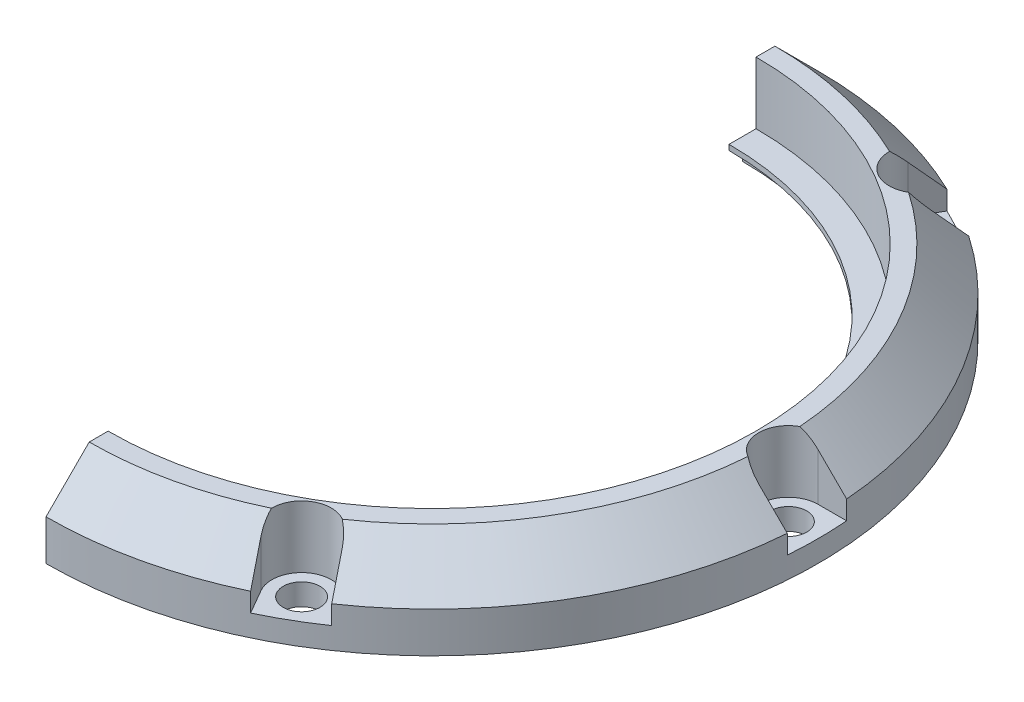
ISO-10303-21;
HEADER;
FILE_DESCRIPTION(('STEP AP214'),'2;1');
FILE_NAME('part.step','',(''),(''),'','','');
FILE_SCHEMA(('AUTOMOTIVE_DESIGN { 1 0 10303 214 1 1 1 1 }'));
ENDSEC;
DATA;
#1=APPLICATION_CONTEXT('core data for automotive mechanical design processes');
#2=APPLICATION_PROTOCOL_DEFINITION('international standard','automotive_design',2000,#1);
#3=PRODUCT_CONTEXT('',#1,'mechanical');
#4=PRODUCT('Part','Part','',(#3));
#5=PRODUCT_RELATED_PRODUCT_CATEGORY('part','',(#4));
#6=PRODUCT_DEFINITION_FORMATION('','',#4);
#7=PRODUCT_DEFINITION_CONTEXT('part definition',#1,'design');
#8=PRODUCT_DEFINITION('design','',#6,#7);
#9=PRODUCT_DEFINITION_SHAPE('','',#8);
#10=(LENGTH_UNIT() NAMED_UNIT(*) SI_UNIT(.MILLI.,.METRE.));
#11=(NAMED_UNIT(*) PLANE_ANGLE_UNIT() SI_UNIT($,.RADIAN.));
#12=(NAMED_UNIT(*) SI_UNIT($,.STERADIAN.) SOLID_ANGLE_UNIT());
#13=UNCERTAINTY_MEASURE_WITH_UNIT(LENGTH_MEASURE(1.E-05),#10,'distance_accuracy_value','');
#14=(GEOMETRIC_REPRESENTATION_CONTEXT(3) GLOBAL_UNCERTAINTY_ASSIGNED_CONTEXT((#13)) GLOBAL_UNIT_ASSIGNED_CONTEXT((#10,
#11,#12)) REPRESENTATION_CONTEXT('',''));
#15=CARTESIAN_POINT('',(0.,0.,0.));
#16=DIRECTION('',(0.,0.,1.));
#17=DIRECTION('',(1.,0.,0.));
#18=AXIS2_PLACEMENT_3D('',#15,#16,#17);
#19=CARTESIAN_POINT('',(0.,-6.5,-12.5));
#20=DIRECTION('',(0.,1.,0.));
#21=DIRECTION('',(0.,0.,1.));
#22=AXIS2_PLACEMENT_3D('',#19,#20,#21);
#23=PLANE('',#22);
#24=CARTESIAN_POINT('',(0.,-6.5,-72.5));
#25=DIRECTION('',(0.,-1.,0.));
#26=DIRECTION('',(0.,0.,-1.));
#27=AXIS2_PLACEMENT_3D('',#24,#25,#26);
#28=CIRCLE('',#27,60.);
#29=CARTESIAN_POINT('',(48.2505378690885,-6.5,-36.8364949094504));
#30=VERTEX_POINT('',#29);
#31=CARTESIAN_POINT('',(0.,-6.5,-12.5));
#32=VERTEX_POINT('',#31);
#33=EDGE_CURVE('E458',#30,#32,#28,.T.);
#34=ORIENTED_EDGE('',*,*,#33,.F.);
#35=CARTESIAN_POINT('',(47.0442744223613,-6.5,-37.7280825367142));
#36=DIRECTION('',(0.,1.,0.));
#37=DIRECTION('',(0.,0.,1.));
#38=AXIS2_PLACEMENT_3D('',#35,#36,#37);
#39=CIRCLE('',#38,1.5);
#40=CARTESIAN_POINT('',(47.9046390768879,-6.5,-38.9568106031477));
#41=VERTEX_POINT('',#40);
#42=EDGE_CURVE('E39',#30,#41,#39,.T.);
#43=ORIENTED_EDGE('',*,*,#42,.T.);
#44=DIRECTION('',(0.819152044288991,0.,0.573576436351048));
#45=VECTOR('',#44,1.);
#46=CARTESIAN_POINT('',(45.0533624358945,-6.5,-40.9532960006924));
#47=LINE('',#46,#45);
#48=CARTESIAN_POINT('',(45.0533624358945,-6.5,-40.9532960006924));
#49=VERTEX_POINT('',#48);
#50=EDGE_CURVE('E901',#49,#41,#47,.T.);
#51=ORIENTED_EDGE('',*,*,#50,.F.);
#52=CARTESIAN_POINT('',(0.,-6.5,-72.5));
#53=DIRECTION('',(0.,-1.,0.));
#54=DIRECTION('',(0.,0.,-1.));
#55=AXIS2_PLACEMENT_3D('',#52,#53,#54);
#56=CIRCLE('',#55,55.);
#57=CARTESIAN_POINT('',(0.,-6.5,-17.5));
#58=VERTEX_POINT('',#57);
#59=EDGE_CURVE('E234',#49,#58,#56,.T.);
#60=ORIENTED_EDGE('',*,*,#59,.T.);
#61=DIRECTION('',(0.,0.,1.));
#62=VECTOR('',#61,1.);
#63=CARTESIAN_POINT('',(0.,-6.5,-12.5));
#64=LINE('',#63,#62);
#65=EDGE_CURVE('E497',#58,#32,#64,.T.);
#66=ORIENTED_EDGE('',*,*,#65,.T.);
#67=EDGE_LOOP('',(#34,#43,#51,#60,#66));
#68=FACE_BOUND('',#67,.T.);
#69=ADVANCED_FACE('F16',(#68),#23,.T.);
#70=DIRECTION('',(-1.,0.,0.));
#71=VECTOR('',#70,1.);
#72=CARTESIAN_POINT('',(55.,-6.5,-72.5));
#73=LINE('',#72,#71);
#74=CARTESIAN_POINT('',(58.4807660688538,-6.5,-72.5));
#75=VERTEX_POINT('',#74);
#76=CARTESIAN_POINT('',(55.,-6.5,-72.5));
#77=VERTEX_POINT('',#76);
#78=EDGE_CURVE('E228',#75,#77,#73,.T.);
#79=ORIENTED_EDGE('',*,*,#78,.F.);
#80=CARTESIAN_POINT('',(58.4807660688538,-6.5,-74.));
#81=DIRECTION('',(0.,1.,0.));
#82=DIRECTION('',(0.,0.,1.));
#83=AXIS2_PLACEMENT_3D('',#80,#81,#82);
#84=CIRCLE('',#83,1.5);
#85=CARTESIAN_POINT('',(59.9802728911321,-6.5,-74.0384615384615));
#86=VERTEX_POINT('',#85);
#87=EDGE_CURVE('E441',#75,#86,#84,.T.);
#88=ORIENTED_EDGE('',*,*,#87,.T.);
#89=CARTESIAN_POINT('',(0.,-6.5,-132.5));
#90=VERTEX_POINT('',#89);
#91=EDGE_CURVE('E455',#90,#86,#28,.T.);
#92=ORIENTED_EDGE('',*,*,#91,.F.);
#93=CARTESIAN_POINT('',(0.,-6.5,-127.5));
#94=VERTEX_POINT('',#93);
#95=EDGE_CURVE('E495',#90,#94,#64,.T.);
#96=ORIENTED_EDGE('',*,*,#95,.T.);
#97=EDGE_CURVE('E309',#94,#77,#56,.T.);
#98=ORIENTED_EDGE('',*,*,#97,.T.);
#99=EDGE_LOOP('',(#79,#88,#92,#96,#98));
#100=FACE_BOUND('',#99,.T.);
#101=ADVANCED_FACE('F397',(#100),#23,.T.);
#102=CARTESIAN_POINT('',(0.,-10.5,-72.5));
#103=DIRECTION('',(0.,-1.,0.));
#104=DIRECTION('',(0.,0.,-1.));
#105=AXIS2_PLACEMENT_3D('',#102,#103,#104);
#106=CYLINDRICAL_SURFACE('',#105,60.);
#107=ORIENTED_EDGE('',*,*,#91,.T.);
#108=DIRECTION('',(0.,-1.,0.));
#109=VECTOR('',#108,1.);
#110=CARTESIAN_POINT('',(59.9802728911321,-10.5,-74.0384615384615));
#111=LINE('',#110,#109);
#112=CARTESIAN_POINT('',(59.9802728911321,-1.49999999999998,-74.0384615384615));
#113=VERTEX_POINT('',#112);
#114=EDGE_CURVE('E431',#86,#113,#111,.F.);
#115=ORIENTED_EDGE('',*,*,#114,.T.);
#116=CARTESIAN_POINT('',(0.,-1.49999999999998,-72.5));
#117=DIRECTION('',(0.,1.,0.));
#118=DIRECTION('',(0.,0.,1.));
#119=AXIS2_PLACEMENT_3D('',#116,#117,#118);
#120=CIRCLE('',#119,60.);
#121=CARTESIAN_POINT('',(48.2505378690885,-1.49999999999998,-36.8364949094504));
#122=VERTEX_POINT('',#121);
#123=EDGE_CURVE('E218',#122,#113,#120,.T.);
#124=ORIENTED_EDGE('',*,*,#123,.F.);
#125=DIRECTION('',(0.,-1.,0.));
#126=VECTOR('',#125,1.);
#127=CARTESIAN_POINT('',(48.2505378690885,-10.5,-36.8364949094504));
#128=LINE('',#127,#126);
#129=EDGE_CURVE('E438',#122,#30,#128,.T.);
#130=ORIENTED_EDGE('',*,*,#129,.T.);
#131=ORIENTED_EDGE('',*,*,#33,.T.);
#132=DIRECTION('',(0.,-1.,0.));
#133=VECTOR('',#132,1.);
#134=CARTESIAN_POINT('',(0.,-10.5,-12.5));
#135=LINE('',#134,#133);
#136=CARTESIAN_POINT('',(0.,5.,-12.5));
#137=VERTEX_POINT('',#136);
#138=EDGE_CURVE('E500',#32,#137,#135,.F.);
#139=ORIENTED_EDGE('',*,*,#138,.T.);
#140=CARTESIAN_POINT('',(0.,5.,-72.5));
#141=DIRECTION('',(0.,-1.,0.));
#142=DIRECTION('',(0.,0.,-1.));
#143=AXIS2_PLACEMENT_3D('',#140,#141,#142);
#144=CIRCLE('',#143,60.);
#145=CARTESIAN_POINT('',(0.,5.,-132.5));
#146=VERTEX_POINT('',#145);
#147=EDGE_CURVE('E459',#146,#137,#144,.T.);
#148=ORIENTED_EDGE('',*,*,#147,.F.);
#149=DIRECTION('',(0.,-1.,0.));
#150=VECTOR('',#149,1.);
#151=CARTESIAN_POINT('',(0.,-10.5,-132.5));
#152=LINE('',#151,#150);
#153=EDGE_CURVE('E498',#146,#90,#152,.T.);
#154=ORIENTED_EDGE('',*,*,#153,.T.);
#155=EDGE_LOOP('',(#107,#115,#124,#130,#131,#139,#148,#154));
#156=FACE_BOUND('',#155,.T.);
#157=ADVANCED_FACE('F296',(#156),#106,.F.);
#158=CARTESIAN_POINT('',(0.,-10.51,-144.));
#159=DIRECTION('',(-1.,0.,0.));
#160=DIRECTION('',(0.,0.,1.));
#161=AXIS2_PLACEMENT_3D('',#158,#159,#160);
#162=PLANE('',#161);
#163=DIRECTION('',(0.,0.707106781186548,-0.707106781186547));
#164=VECTOR('',#163,1.);
#165=CARTESIAN_POINT('',(0.,68.5,-72.5));
#166=LINE('',#165,#164);
#167=CARTESIAN_POINT('',(0.,5.,-9.));
#168=VERTEX_POINT('',#167);
#169=CARTESIAN_POINT('',(0.,-3.,-1.));
#170=VERTEX_POINT('',#169);
#171=EDGE_CURVE('E487',#168,#170,#166,.F.);
#172=ORIENTED_EDGE('',*,*,#171,.F.);
#173=DIRECTION('',(0.,0.,1.));
#174=VECTOR('',#173,1.);
#175=CARTESIAN_POINT('',(0.,5.,-9.));
#176=LINE('',#175,#174);
#177=EDGE_CURVE('E504',#137,#168,#176,.T.);
#178=ORIENTED_EDGE('',*,*,#177,.F.);
#179=ORIENTED_EDGE('',*,*,#138,.F.);
#180=ORIENTED_EDGE('',*,*,#65,.F.);
#181=DIRECTION('',(0.,-1.,0.));
#182=VECTOR('',#181,1.);
#183=CARTESIAN_POINT('',(0.,-10.5,-17.5));
#184=LINE('',#183,#182);
#185=CARTESIAN_POINT('',(0.,-7.5,-17.5));
#186=VERTEX_POINT('',#185);
#187=EDGE_CURVE('E482',#186,#58,#184,.F.);
#188=ORIENTED_EDGE('',*,*,#187,.F.);
#189=DIRECTION('',(0.,0.,-1.));
#190=VECTOR('',#189,1.);
#191=CARTESIAN_POINT('',(0.,-7.5,-72.5));
#192=LINE('',#191,#190);
#193=CARTESIAN_POINT('',(0.,-7.5,-15.));
#194=VERTEX_POINT('',#193);
#195=EDGE_CURVE('E511',#194,#186,#192,.T.);
#196=ORIENTED_EDGE('',*,*,#195,.F.);
#197=DIRECTION('',(0.,-1.,0.));
#198=VECTOR('',#197,1.);
#199=CARTESIAN_POINT('',(0.,-7.5,-15.));
#200=LINE('',#199,#198);
#201=CARTESIAN_POINT('',(0.,-10.5,-15.));
#202=VERTEX_POINT('',#201);
#203=EDGE_CURVE('E235',#194,#202,#200,.T.);
#204=ORIENTED_EDGE('',*,*,#203,.T.);
#205=DIRECTION('',(0.,0.,-1.));
#206=VECTOR('',#205,1.);
#207=CARTESIAN_POINT('',(0.,-10.5,-1000.));
#208=LINE('',#207,#206);
#209=CARTESIAN_POINT('',(0.,-10.5,-1.));
#210=VERTEX_POINT('',#209);
#211=EDGE_CURVE('E506',#210,#202,#208,.T.);
#212=ORIENTED_EDGE('',*,*,#211,.F.);
#213=DIRECTION('',(0.,-1.,0.));
#214=VECTOR('',#213,1.);
#215=CARTESIAN_POINT('',(0.,-10.5,-1.00000000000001));
#216=LINE('',#215,#214);
#217=EDGE_CURVE('E492',#170,#210,#216,.T.);
#218=ORIENTED_EDGE('',*,*,#217,.F.);
#219=EDGE_LOOP('',(#172,#178,#179,#180,#188,#196,#204,#212,#218));
#220=FACE_BOUND('',#219,.T.);
#221=ADVANCED_FACE('F379',(#220),#162,.T.);
#222=DIRECTION('',(0.,-0.707106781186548,-0.707106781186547));
#223=VECTOR('',#222,1.);
#224=CARTESIAN_POINT('',(0.,68.5,-72.5));
#225=LINE('',#224,#223);
#226=CARTESIAN_POINT('',(0.,-3.,-144.));
#227=VERTEX_POINT('',#226);
#228=CARTESIAN_POINT('',(0.,5.,-136.));
#229=VERTEX_POINT('',#228);
#230=EDGE_CURVE('E484',#227,#229,#225,.F.);
#231=ORIENTED_EDGE('',*,*,#230,.F.);
#232=DIRECTION('',(0.,-1.,0.));
#233=VECTOR('',#232,1.);
#234=CARTESIAN_POINT('',(0.,-10.5,-144.));
#235=LINE('',#234,#233);
#236=CARTESIAN_POINT('',(0.,-10.5,-144.));
#237=VERTEX_POINT('',#236);
#238=EDGE_CURVE('E490',#237,#227,#235,.F.);
#239=ORIENTED_EDGE('',*,*,#238,.F.);
#240=CARTESIAN_POINT('',(0.,-10.5,-130.));
#241=VERTEX_POINT('',#240);
#242=EDGE_CURVE('E509',#241,#237,#208,.T.);
#243=ORIENTED_EDGE('',*,*,#242,.F.);
#244=DIRECTION('',(0.,-1.,0.));
#245=VECTOR('',#244,1.);
#246=CARTESIAN_POINT('',(0.,-7.5,-130.));
#247=LINE('',#246,#245);
#248=CARTESIAN_POINT('',(0.,-7.5,-130.));
#249=VERTEX_POINT('',#248);
#250=EDGE_CURVE('E239',#241,#249,#247,.F.);
#251=ORIENTED_EDGE('',*,*,#250,.T.);
#252=CARTESIAN_POINT('',(0.,-7.5,-127.5));
#253=VERTEX_POINT('',#252);
#254=EDGE_CURVE('E248',#253,#249,#192,.T.);
#255=ORIENTED_EDGE('',*,*,#254,.F.);
#256=DIRECTION('',(0.,-1.,0.));
#257=VECTOR('',#256,1.);
#258=CARTESIAN_POINT('',(0.,-10.5,-127.5));
#259=LINE('',#258,#257);
#260=EDGE_CURVE('E479',#94,#253,#259,.T.);
#261=ORIENTED_EDGE('',*,*,#260,.F.);
#262=ORIENTED_EDGE('',*,*,#95,.F.);
#263=ORIENTED_EDGE('',*,*,#153,.F.);
#264=EDGE_CURVE('E503',#229,#146,#176,.T.);
#265=ORIENTED_EDGE('',*,*,#264,.F.);
#266=EDGE_LOOP('',(#231,#239,#243,#251,#255,#261,#262,#263,#265));
#267=FACE_BOUND('',#266,.T.);
#268=ADVANCED_FACE('F294',(#267),#162,.T.);
#269=CARTESIAN_POINT('',(28.2368602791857,5.,-12.5923233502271));
#270=DIRECTION('',(0.866025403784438,0.,-0.5));
#271=DIRECTION('',(-0.5,0.,-0.866025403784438));
#272=AXIS2_PLACEMENT_3D('',#269,#270,#271);
#273=PLANE('',#272);
#274=DIRECTION('',(0.,-1.,0.));
#275=VECTOR('',#274,1.);
#276=CARTESIAN_POINT('',(30.8809341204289,-10.5,-8.01265311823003));
#277=LINE('',#276,#275);
#278=CARTESIAN_POINT('',(30.8809341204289,-6.5,-8.01265311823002));
#279=VERTEX_POINT('',#278);
#280=CARTESIAN_POINT('',(30.8809341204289,-3.,-8.01265311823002));
#281=VERTEX_POINT('',#280);
#282=EDGE_CURVE('E618',#279,#281,#277,.F.);
#283=ORIENTED_EDGE('',*,*,#282,.F.);
#284=DIRECTION('',(0.5,0.,0.866025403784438));
#285=VECTOR('',#284,1.);
#286=CARTESIAN_POINT('',(28.2368602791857,-6.5,-12.5923233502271));
#287=LINE('',#286,#285);
#288=CARTESIAN_POINT('',(28.2368602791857,-6.5,-12.5923233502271));
#289=VERTEX_POINT('',#288);
#290=EDGE_CURVE('E326',#289,#279,#287,.T.);
#291=ORIENTED_EDGE('',*,*,#290,.F.);
#292=DIRECTION('',(0.,-1.,0.));
#293=VECTOR('',#292,1.);
#294=CARTESIAN_POINT('',(28.2368602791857,5.,-12.5923233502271));
#295=LINE('',#294,#293);
#296=CARTESIAN_POINT('',(28.2368602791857,2.27122981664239,-12.5923233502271));
#297=VERTEX_POINT('',#296);
#298=EDGE_CURVE('E316',#297,#289,#295,.T.);
#299=ORIENTED_EDGE('',*,*,#298,.F.);
#300=CARTESIAN_POINT('',(30.8810344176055,-3.0002,-8.01247939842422));
#301=CARTESIAN_POINT('',(30.4403735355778,-2.12148155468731,-8.77572643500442));
#302=CARTESIAN_POINT('',(29.999685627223,-1.24281733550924,-9.53902028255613));
#303=CARTESIAN_POINT('',(29.1182557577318,0.514402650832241,-11.0657015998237));
#304=CARTESIAN_POINT('',(28.6775137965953,1.39295841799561,-11.8290890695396));
#305=CARTESIAN_POINT('',(28.2367448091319,2.27145995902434,-12.5925233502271));
#306=B_SPLINE_CURVE_WITH_KNOTS('',3,(#300,#301,#302,#303,#304,#305),.UNSPECIFIED.,.F.,.F.,(4,2,
4),(0.,3.73361316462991,7.46722633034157),.UNSPECIFIED.);
#307=EDGE_CURVE('E301',#281,#297,#306,.T.);
#308=ORIENTED_EDGE('',*,*,#307,.F.);
#309=EDGE_LOOP('',(#283,#291,#299,#308));
#310=FACE_BOUND('',#309,.T.);
#311=ADVANCED_FACE('F288',(#310),#273,.T.);
#312=CARTESIAN_POINT('',(33.,-6.5,-15.3423233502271));
#313=DIRECTION('',(0.,1.,0.));
#314=DIRECTION('',(0.,0.,1.));
#315=AXIS2_PLACEMENT_3D('',#312,#313,#314);
#316=PLANE('',#315);
#317=CARTESIAN_POINT('',(33.,-6.5,-15.3423233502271));
#318=DIRECTION('',(0.,1.,0.));
#319=DIRECTION('',(0.,0.,1.));
#320=AXIS2_PLACEMENT_3D('',#317,#318,#319);
#321=CIRCLE('',#320,3.4);
#322=CARTESIAN_POINT('',(33.,-6.5,-11.9423233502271));
#323=VERTEX_POINT('',#322);
#324=EDGE_CURVE('E333',#323,#323,#321,.T.);
#325=ORIENTED_EDGE('',*,*,#324,.F.);
#326=EDGE_LOOP('',(#325));
#327=FACE_BOUND('',#326,.T.);
#328=CARTESIAN_POINT('',(33.,-6.5,-15.3423233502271));
#329=DIRECTION('',(0.,1.,0.));
#330=DIRECTION('',(0.,0.,1.));
#331=AXIS2_PLACEMENT_3D('',#328,#329,#330);
#332=CIRCLE('',#331,5.5);
#333=CARTESIAN_POINT('',(37.7631397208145,-6.5,-18.0923233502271));
#334=VERTEX_POINT('',#333);
#335=EDGE_CURVE('E328',#334,#289,#332,.T.);
#336=ORIENTED_EDGE('',*,*,#335,.T.);
#337=ORIENTED_EDGE('',*,*,#290,.T.);
#338=CARTESIAN_POINT('',(0.,-6.5,-72.5));
#339=DIRECTION('',(0.,1.,0.));
#340=DIRECTION('',(0.,0.,1.));
#341=AXIS2_PLACEMENT_3D('',#338,#339,#340);
#342=CIRCLE('',#341,71.5);
#343=CARTESIAN_POINT('',(40.4072135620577,-6.5,-13.51265311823));
#344=VERTEX_POINT('',#343);
#345=EDGE_CURVE('E324',#279,#344,#342,.T.);
#346=ORIENTED_EDGE('',*,*,#345,.T.);
#347=DIRECTION('',(-0.5,0.,-0.866025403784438));
#348=VECTOR('',#347,1.);
#349=CARTESIAN_POINT('',(37.7631397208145,-6.5,-18.0923233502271));
#350=LINE('',#349,#348);
#351=EDGE_CURVE('E321',#344,#334,#350,.T.);
#352=ORIENTED_EDGE('',*,*,#351,.T.);
#353=EDGE_LOOP('',(#336,#337,#346,#352));
#354=FACE_BOUND('',#353,.T.);
#355=ADVANCED_FACE('F293',(#327,#354),#316,.T.);
#356=CARTESIAN_POINT('',(37.7631397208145,5.,-18.0923233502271));
#357=DIRECTION('',(-0.866025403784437,0.,0.5));
#358=DIRECTION('',(0.5,0.,0.866025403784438));
#359=AXIS2_PLACEMENT_3D('',#356,#357,#358);
#360=PLANE('',#359);
#361=DIRECTION('',(0.,-1.,0.));
#362=VECTOR('',#361,1.);
#363=CARTESIAN_POINT('',(37.7631397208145,5.,-18.0923233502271));
#364=LINE('',#363,#362);
#365=CARTESIAN_POINT('',(37.7631397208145,2.27122981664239,-18.0923233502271));
#366=VERTEX_POINT('',#365);
#367=EDGE_CURVE('E318',#366,#334,#364,.T.);
#368=ORIENTED_EDGE('',*,*,#367,.T.);
#369=ORIENTED_EDGE('',*,*,#351,.F.);
#370=DIRECTION('',(0.,-1.,0.));
#371=VECTOR('',#370,1.);
#372=CARTESIAN_POINT('',(40.4072135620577,-10.5,-13.51265311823));
#373=LINE('',#372,#371);
#374=CARTESIAN_POINT('',(40.4072135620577,-3.,-13.51265311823));
#375=VERTEX_POINT('',#374);
#376=EDGE_CURVE('E310',#375,#344,#373,.T.);
#377=ORIENTED_EDGE('',*,*,#376,.F.);
#378=CARTESIAN_POINT('',(37.7630242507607,2.27145995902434,-18.0925233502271));
#379=CARTESIAN_POINT('',(38.2037932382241,1.39295841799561,-17.3290890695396));
#380=CARTESIAN_POINT('',(38.6445351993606,0.514402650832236,-16.5657015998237));
#381=CARTESIAN_POINT('',(39.5259650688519,-1.24281733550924,-15.0390202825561));
#382=CARTESIAN_POINT('',(39.9666529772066,-2.12148155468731,-14.2757264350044));
#383=CARTESIAN_POINT('',(40.4073138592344,-3.0002,-13.5124793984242));
#384=B_SPLINE_CURVE_WITH_KNOTS('',3,(#378,#379,#380,#381,#382,#383),.UNSPECIFIED.,.F.,.F.,(4,2,
4),(0.,3.73361316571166,7.46722633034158),.UNSPECIFIED.);
#385=EDGE_CURVE('E308',#366,#375,#384,.T.);
#386=ORIENTED_EDGE('',*,*,#385,.F.);
#387=EDGE_LOOP('',(#368,#369,#377,#386));
#388=FACE_BOUND('',#387,.T.);
#389=ADVANCED_FACE('F297',(#388),#360,.T.);
#390=CARTESIAN_POINT('',(66.,5.,-67.));
#391=DIRECTION('',(0.,0.,-1.));
#392=DIRECTION('',(-1.,0.,0.));
#393=AXIS2_PLACEMENT_3D('',#390,#391,#392);
#394=PLANE('',#393);
#395=DIRECTION('',(0.,-1.,0.));
#396=VECTOR('',#395,1.);
#397=CARTESIAN_POINT('',(71.2881476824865,-10.5,-67.));
#398=LINE('',#397,#396);
#399=CARTESIAN_POINT('',(71.2881476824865,-6.5,-67.));
#400=VERTEX_POINT('',#399);
#401=CARTESIAN_POINT('',(71.2881476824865,-3.,-67.));
#402=VERTEX_POINT('',#401);
#403=EDGE_CURVE('E244',#400,#402,#398,.F.);
#404=ORIENTED_EDGE('',*,*,#403,.F.);
#405=DIRECTION('',(1.,0.,0.));
#406=VECTOR('',#405,1.);
#407=CARTESIAN_POINT('',(66.,-6.5,-67.));
#408=LINE('',#407,#406);
#409=CARTESIAN_POINT('',(66.,-6.5,-67.));
#410=VERTEX_POINT('',#409);
#411=EDGE_CURVE('E528',#410,#400,#408,.T.);
#412=ORIENTED_EDGE('',*,*,#411,.F.);
#413=DIRECTION('',(0.,-1.,0.));
#414=VECTOR('',#413,1.);
#415=CARTESIAN_POINT('',(66.,5.,-67.));
#416=LINE('',#415,#414);
#417=CARTESIAN_POINT('',(66.,2.27122981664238,-67.));
#418=VERTEX_POINT('',#417);
#419=EDGE_CURVE('E538',#418,#410,#416,.T.);
#420=ORIENTED_EDGE('',*,*,#419,.F.);
#421=CARTESIAN_POINT('',(80.8781602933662,-12.5649542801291,-67.));
#422=CARTESIAN_POINT('',(78.8401535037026,-10.5316539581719,-67.));
#423=CARTESIAN_POINT('',(76.8019801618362,-8.4985205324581,-67.));
#424=CARTESIAN_POINT('',(72.7251831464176,-4.43270559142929,-67.));
#425=CARTESIAN_POINT('',(70.6865594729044,-2.40002407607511,-67.));
#426=CARTESIAN_POINT('',(66.6087441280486,1.66476936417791,-67.));
#427=CARTESIAN_POINT('',(64.5695524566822,3.69688128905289,-67.));
#428=CARTESIAN_POINT('',(60.4903984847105,7.76033186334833,-67.));
#429=CARTESIAN_POINT('',(58.4504361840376,9.79167051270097,-67.));
#430=CARTESIAN_POINT('',(56.4099873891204,11.8225205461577,-67.));
#431=B_SPLINE_CURVE_WITH_KNOTS('',3,(#421,#422,#423,#424,#425,#426,#427,#428,#429,#430),
.UNSPECIFIED.,.F.,.F.,(4,2,2,2,4),(0.,8.63655240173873,17.2731040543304,25.9096560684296,
34.5462088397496),.UNSPECIFIED.);
#432=EDGE_CURVE('E336',#402,#418,#431,.T.);
#433=ORIENTED_EDGE('',*,*,#432,.F.);
#434=EDGE_LOOP('',(#404,#412,#420,#433));
#435=FACE_BOUND('',#434,.T.);
#436=ADVANCED_FACE('F351',(#435),#394,.T.);
#437=CARTESIAN_POINT('',(66.,-6.5,-72.5));
#438=DIRECTION('',(0.,1.,0.));
#439=DIRECTION('',(0.86602540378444,0.,0.5));
#440=AXIS2_PLACEMENT_3D('',#437,#438,#439);
#441=PLANE('',#440);
#442=CARTESIAN_POINT('',(66.,-6.5,-72.5));
#443=DIRECTION('',(0.,1.,0.));
#444=DIRECTION('',(0.86602540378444,0.,0.5));
#445=AXIS2_PLACEMENT_3D('',#442,#443,#444);
#446=CIRCLE('',#445,3.4);
#447=CARTESIAN_POINT('',(68.9444863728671,-6.5,-70.8));
#448=VERTEX_POINT('',#447);
#449=EDGE_CURVE('E515',#448,#448,#446,.T.);
#450=ORIENTED_EDGE('',*,*,#449,.F.);
#451=EDGE_LOOP('',(#450));
#452=FACE_BOUND('',#451,.T.);
#453=CARTESIAN_POINT('',(66.,-6.5,-72.5));
#454=DIRECTION('',(0.,1.,0.));
#455=DIRECTION('',(0.86602540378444,0.,0.5));
#456=AXIS2_PLACEMENT_3D('',#453,#454,#455);
#457=CIRCLE('',#456,5.5);
#458=CARTESIAN_POINT('',(66.,-6.5,-78.));
#459=VERTEX_POINT('',#458);
#460=EDGE_CURVE('E524',#459,#410,#457,.T.);
#461=ORIENTED_EDGE('',*,*,#460,.T.);
#462=ORIENTED_EDGE('',*,*,#411,.T.);
#463=CARTESIAN_POINT('',(0.,-6.5,-72.5));
#464=DIRECTION('',(0.,1.,0.));
#465=DIRECTION('',(0.86602540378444,0.,0.5));
#466=AXIS2_PLACEMENT_3D('',#463,#464,#465);
#467=CIRCLE('',#466,71.5);
#468=CARTESIAN_POINT('',(71.2881476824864,-6.5,-78.));
#469=VERTEX_POINT('',#468);
#470=EDGE_CURVE('E531',#400,#469,#467,.T.);
#471=ORIENTED_EDGE('',*,*,#470,.T.);
#472=DIRECTION('',(-1.,0.,0.));
#473=VECTOR('',#472,1.);
#474=CARTESIAN_POINT('',(66.,-6.5,-78.));
#475=LINE('',#474,#473);
#476=EDGE_CURVE('E533',#469,#459,#475,.T.);
#477=ORIENTED_EDGE('',*,*,#476,.T.);
#478=EDGE_LOOP('',(#461,#462,#471,#477));
#479=FACE_BOUND('',#478,.T.);
#480=ADVANCED_FACE('F355',(#452,#479),#441,.T.);
#481=CARTESIAN_POINT('',(66.,5.,-78.));
#482=DIRECTION('',(0.,0.,1.));
#483=DIRECTION('',(1.,0.,0.));
#484=AXIS2_PLACEMENT_3D('',#481,#482,#483);
#485=PLANE('',#484);
#486=DIRECTION('',(0.,-1.,0.));
#487=VECTOR('',#486,1.);
#488=CARTESIAN_POINT('',(66.,5.,-78.));
#489=LINE('',#488,#487);
#490=CARTESIAN_POINT('',(66.,2.27122981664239,-78.));
#491=VERTEX_POINT('',#490);
#492=EDGE_CURVE('E536',#491,#459,#489,.T.);
#493=ORIENTED_EDGE('',*,*,#492,.T.);
#494=ORIENTED_EDGE('',*,*,#476,.F.);
#495=DIRECTION('',(0.,-1.,0.));
#496=VECTOR('',#495,1.);
#497=CARTESIAN_POINT('',(71.2881476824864,-10.5,-78.));
#498=LINE('',#497,#496);
#499=CARTESIAN_POINT('',(71.2881476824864,-3.,-78.));
#500=VERTEX_POINT('',#499);
#501=EDGE_CURVE('E247',#500,#469,#498,.T.);
#502=ORIENTED_EDGE('',*,*,#501,.F.);
#503=CARTESIAN_POINT('',(56.4099873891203,11.8225205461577,-78.));
#504=CARTESIAN_POINT('',(58.4504361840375,9.79167051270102,-78.));
#505=CARTESIAN_POINT('',(60.4903984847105,7.76033186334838,-78.));
#506=CARTESIAN_POINT('',(64.5695524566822,3.69688128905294,-78.));
#507=CARTESIAN_POINT('',(66.6087441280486,1.66476936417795,-78.));
#508=CARTESIAN_POINT('',(70.6865594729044,-2.40002407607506,-78.));
#509=CARTESIAN_POINT('',(72.7251831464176,-4.43270559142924,-78.));
#510=CARTESIAN_POINT('',(76.8019801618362,-8.49852053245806,-78.));
#511=CARTESIAN_POINT('',(78.8401535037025,-10.5316539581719,-78.));
#512=CARTESIAN_POINT('',(80.8781602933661,-12.5649542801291,-78.));
#513=B_SPLINE_CURVE_WITH_KNOTS('',3,(#503,#504,#505,#506,#507,#508,#509,#510,#511,#512),
.UNSPECIFIED.,.F.,.F.,(4,2,2,2,4),(0.,8.6365527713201,17.2731047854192,25.9096564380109,
34.5462088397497),.UNSPECIFIED.);
#514=EDGE_CURVE('E345',#491,#500,#513,.T.);
#515=ORIENTED_EDGE('',*,*,#514,.F.);
#516=EDGE_LOOP('',(#493,#494,#502,#515));
#517=FACE_BOUND('',#516,.T.);
#518=ADVANCED_FACE('F360',(#517),#485,.T.);
#519=CARTESIAN_POINT('',(37.7631397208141,5.,-126.907676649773));
#520=DIRECTION('',(-0.866025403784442,0.,-0.5));
#521=DIRECTION('',(-0.5,0.,0.866025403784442));
#522=AXIS2_PLACEMENT_3D('',#519,#520,#521);
#523=PLANE('',#522);
#524=DIRECTION('',(0.,-1.,0.));
#525=VECTOR('',#524,1.);
#526=CARTESIAN_POINT('',(40.4072135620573,-10.5,-131.48734688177));
#527=LINE('',#526,#525);
#528=CARTESIAN_POINT('',(40.4072135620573,-6.5,-131.48734688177));
#529=VERTEX_POINT('',#528);
#530=CARTESIAN_POINT('',(40.4072135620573,-3.,-131.48734688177));
#531=VERTEX_POINT('',#530);
#532=EDGE_CURVE('E251',#529,#531,#527,.F.);
#533=ORIENTED_EDGE('',*,*,#532,.F.);
#534=DIRECTION('',(0.5,0.,-0.866025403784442));
#535=VECTOR('',#534,1.);
#536=CARTESIAN_POINT('',(37.7631397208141,-6.5,-126.907676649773));
#537=LINE('',#536,#535);
#538=CARTESIAN_POINT('',(37.7631397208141,-6.5,-126.907676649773));
#539=VERTEX_POINT('',#538);
#540=EDGE_CURVE('E543',#539,#529,#537,.T.);
#541=ORIENTED_EDGE('',*,*,#540,.F.);
#542=DIRECTION('',(0.,-1.,0.));
#543=VECTOR('',#542,1.);
#544=CARTESIAN_POINT('',(37.7631397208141,5.,-126.907676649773));
#545=LINE('',#544,#543);
#546=CARTESIAN_POINT('',(37.7631397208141,2.27122981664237,-126.907676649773));
#547=VERTEX_POINT('',#546);
#548=EDGE_CURVE('E527',#547,#539,#545,.T.);
#549=ORIENTED_EDGE('',*,*,#548,.F.);
#550=CARTESIAN_POINT('',(40.4073138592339,-3.0002,-131.487520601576));
#551=CARTESIAN_POINT('',(39.9666529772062,-2.12148155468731,-130.724273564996));
#552=CARTESIAN_POINT('',(39.5259650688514,-1.24281733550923,-129.960979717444));
#553=CARTESIAN_POINT('',(38.6445351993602,0.514402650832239,-128.434298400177));
#554=CARTESIAN_POINT('',(38.2037932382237,1.3929584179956,-127.670910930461));
#555=CARTESIAN_POINT('',(37.7630242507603,2.27145995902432,-126.907476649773));
#556=B_SPLINE_CURVE_WITH_KNOTS('',3,(#550,#551,#552,#553,#554,#555),.UNSPECIFIED.,.F.,.F.,(4,2,
4),(0.,3.73361316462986,7.46722633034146),.UNSPECIFIED.);
#557=EDGE_CURVE('E579',#531,#547,#556,.T.);
#558=ORIENTED_EDGE('',*,*,#557,.F.);
#559=EDGE_LOOP('',(#533,#541,#549,#558));
#560=FACE_BOUND('',#559,.T.);
#561=ADVANCED_FACE('F364',(#560),#523,.T.);
#562=CARTESIAN_POINT('',(32.9999999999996,-6.5,-129.657676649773));
#563=DIRECTION('',(0.,1.,0.));
#564=DIRECTION('',(0.866025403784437,0.,-0.5));
#565=AXIS2_PLACEMENT_3D('',#562,#563,#564);
#566=PLANE('',#565);
#567=CARTESIAN_POINT('',(32.9999999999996,-6.5,-129.657676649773));
#568=DIRECTION('',(0.,1.,0.));
#569=DIRECTION('',(0.866025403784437,0.,-0.5));
#570=AXIS2_PLACEMENT_3D('',#567,#568,#569);
#571=CIRCLE('',#570,3.4);
#572=CARTESIAN_POINT('',(35.9444863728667,-6.5,-131.357676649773));
#573=VERTEX_POINT('',#572);
#574=EDGE_CURVE('E452',#573,#573,#571,.T.);
#575=ORIENTED_EDGE('',*,*,#574,.F.);
#576=EDGE_LOOP('',(#575));
#577=FACE_BOUND('',#576,.T.);
#578=CARTESIAN_POINT('',(32.9999999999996,-6.5,-129.657676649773));
#579=DIRECTION('',(0.,1.,0.));
#580=DIRECTION('',(0.866025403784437,0.,-0.5));
#581=AXIS2_PLACEMENT_3D('',#578,#579,#580);
#582=CIRCLE('',#581,5.5);
#583=CARTESIAN_POINT('',(28.2368602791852,-6.5,-132.407676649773));
#584=VERTEX_POINT('',#583);
#585=EDGE_CURVE('E516',#584,#539,#582,.T.);
#586=ORIENTED_EDGE('',*,*,#585,.T.);
#587=ORIENTED_EDGE('',*,*,#540,.T.);
#588=CARTESIAN_POINT('',(0.,-6.5,-72.5));
#589=DIRECTION('',(0.,1.,0.));
#590=DIRECTION('',(0.866025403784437,0.,-0.5));
#591=AXIS2_PLACEMENT_3D('',#588,#589,#590);
#592=CIRCLE('',#591,71.5);
#593=CARTESIAN_POINT('',(30.8809341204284,-6.5,-136.98734688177));
#594=VERTEX_POINT('',#593);
#595=EDGE_CURVE('E546',#529,#594,#592,.T.);
#596=ORIENTED_EDGE('',*,*,#595,.T.);
#597=DIRECTION('',(-0.499999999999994,0.,0.866025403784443));
#598=VECTOR('',#597,1.);
#599=CARTESIAN_POINT('',(28.2368602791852,-6.5,-132.407676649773));
#600=LINE('',#599,#598);
#601=EDGE_CURVE('E548',#594,#584,#600,.T.);
#602=ORIENTED_EDGE('',*,*,#601,.T.);
#603=EDGE_LOOP('',(#586,#587,#596,#602));
#604=FACE_BOUND('',#603,.T.);
#605=ADVANCED_FACE('F575',(#577,#604),#566,.T.);
#606=CARTESIAN_POINT('',(28.2368602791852,5.,-132.407676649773));
#607=DIRECTION('',(0.866025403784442,0.,0.499999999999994));
#608=DIRECTION('',(0.499999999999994,0.,-0.866025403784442));
#609=AXIS2_PLACEMENT_3D('',#606,#607,#608);
#610=PLANE('',#609);
#611=DIRECTION('',(0.,-1.,0.));
#612=VECTOR('',#611,1.);
#613=CARTESIAN_POINT('',(28.2368602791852,5.,-132.407676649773));
#614=LINE('',#613,#612);
#615=CARTESIAN_POINT('',(28.2368602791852,2.27122981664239,-132.407676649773));
#616=VERTEX_POINT('',#615);
#617=EDGE_CURVE('E551',#616,#584,#614,.T.);
#618=ORIENTED_EDGE('',*,*,#617,.T.);
#619=ORIENTED_EDGE('',*,*,#601,.F.);
#620=DIRECTION('',(0.,-1.,0.));
#621=VECTOR('',#620,1.);
#622=CARTESIAN_POINT('',(30.8809341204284,-10.5,-136.98734688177));
#623=LINE('',#622,#621);
#624=CARTESIAN_POINT('',(30.8809341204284,-3.,-136.98734688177));
#625=VERTEX_POINT('',#624);
#626=EDGE_CURVE('E254',#625,#594,#623,.T.);
#627=ORIENTED_EDGE('',*,*,#626,.F.);
#628=CARTESIAN_POINT('',(28.2367448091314,2.27145995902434,-132.407476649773));
#629=CARTESIAN_POINT('',(28.6775137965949,1.39295841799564,-133.17091093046));
#630=CARTESIAN_POINT('',(29.1182557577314,0.514402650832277,-133.934298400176));
#631=CARTESIAN_POINT('',(29.9996856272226,-1.2428173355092,-135.460979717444));
#632=CARTESIAN_POINT('',(30.4403735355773,-2.12148155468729,-136.224273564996));
#633=CARTESIAN_POINT('',(30.8810344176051,-3.0002,-136.987520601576));
#634=B_SPLINE_CURVE_WITH_KNOTS('',3,(#628,#629,#630,#631,#632,#633),.UNSPECIFIED.,.F.,.F.,(4,2,
4),(0.,3.73361316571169,7.46722633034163),.UNSPECIFIED.);
#635=EDGE_CURVE('E585',#616,#625,#634,.T.);
#636=ORIENTED_EDGE('',*,*,#635,.F.);
#637=EDGE_LOOP('',(#618,#619,#627,#636));
#638=FACE_BOUND('',#637,.T.);
#639=ADVANCED_FACE('F577',(#638),#610,.T.);
#640=CARTESIAN_POINT('',(0.,-10.5,-72.5));
#641=DIRECTION('',(0.,-1.,0.));
#642=DIRECTION('',(0.,0.,-1.));
#643=AXIS2_PLACEMENT_3D('',#640,#641,#642);
#644=CYLINDRICAL_SURFACE('',#643,71.5);
#645=CARTESIAN_POINT('',(0.,-10.5,-72.5));
#646=DIRECTION('',(0.,-1.,0.));
#647=DIRECTION('',(0.,0.,-1.));
#648=AXIS2_PLACEMENT_3D('',#645,#646,#647);
#649=CIRCLE('',#648,71.5);
#650=EDGE_CURVE('E473',#237,#210,#649,.T.);
#651=ORIENTED_EDGE('',*,*,#650,.F.);
#652=ORIENTED_EDGE('',*,*,#238,.T.);
#653=CARTESIAN_POINT('',(0.,-3.,-72.5));
#654=DIRECTION('',(0.,-1.,0.));
#655=DIRECTION('',(0.,0.,-1.));
#656=AXIS2_PLACEMENT_3D('',#653,#654,#655);
#657=CIRCLE('',#656,71.5);
#658=EDGE_CURVE('E472',#227,#625,#657,.T.);
#659=ORIENTED_EDGE('',*,*,#658,.T.);
#660=ORIENTED_EDGE('',*,*,#626,.T.);
#661=ORIENTED_EDGE('',*,*,#595,.F.);
#662=ORIENTED_EDGE('',*,*,#532,.T.);
#663=EDGE_CURVE('E474',#531,#500,#657,.T.);
#664=ORIENTED_EDGE('',*,*,#663,.T.);
#665=ORIENTED_EDGE('',*,*,#501,.T.);
#666=ORIENTED_EDGE('',*,*,#470,.F.);
#667=ORIENTED_EDGE('',*,*,#403,.T.);
#668=EDGE_CURVE('E467',#402,#375,#657,.T.);
#669=ORIENTED_EDGE('',*,*,#668,.T.);
#670=ORIENTED_EDGE('',*,*,#376,.T.);
#671=ORIENTED_EDGE('',*,*,#345,.F.);
#672=ORIENTED_EDGE('',*,*,#282,.T.);
#673=EDGE_CURVE('E469',#281,#170,#657,.T.);
#674=ORIENTED_EDGE('',*,*,#673,.T.);
#675=ORIENTED_EDGE('',*,*,#217,.T.);
#676=EDGE_LOOP('',(#651,#652,#659,#660,#661,#662,#664,#665,#666,#667,#669,#670,#671,#672,#674,#675));
#677=FACE_BOUND('',#676,.T.);
#678=ADVANCED_FACE('F377',(#677),#644,.T.);
#679=CARTESIAN_POINT('',(66.,-10.5,-72.5));
#680=DIRECTION('',(0.,1.,0.));
#681=DIRECTION('',(0.,0.,1.));
#682=AXIS2_PLACEMENT_3D('',#679,#680,#681);
#683=CYLINDRICAL_SURFACE('',#682,3.4);
#684=CARTESIAN_POINT('',(66.,-10.5,-72.5));
#685=DIRECTION('',(0.,1.,0.));
#686=DIRECTION('',(0.86602540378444,0.,0.5));
#687=AXIS2_PLACEMENT_3D('',#684,#685,#686);
#688=CIRCLE('',#687,3.4);
#689=CARTESIAN_POINT('',(68.9444863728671,-10.5,-70.8));
#690=VERTEX_POINT('',#689);
#691=EDGE_CURVE('E512',#690,#690,#688,.T.);
#692=ORIENTED_EDGE('',*,*,#691,.F.);
#693=EDGE_LOOP('',(#692));
#694=FACE_BOUND('',#693,.T.);
#695=ORIENTED_EDGE('',*,*,#449,.T.);
#696=EDGE_LOOP('',(#695));
#697=FACE_BOUND('',#696,.T.);
#698=ADVANCED_FACE('F373',(#694,#697),#683,.F.);
#699=CARTESIAN_POINT('',(32.9999999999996,-10.5,-129.657676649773));
#700=DIRECTION('',(0.,1.,0.));
#701=DIRECTION('',(0.,0.,1.));
#702=AXIS2_PLACEMENT_3D('',#699,#700,#701);
#703=CYLINDRICAL_SURFACE('',#702,3.4);
#704=CARTESIAN_POINT('',(32.9999999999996,-10.5,-129.657676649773));
#705=DIRECTION('',(0.,1.,0.));
#706=DIRECTION('',(0.866025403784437,0.,-0.5));
#707=AXIS2_PLACEMENT_3D('',#704,#705,#706);
#708=CIRCLE('',#707,3.4);
#709=CARTESIAN_POINT('',(35.9444863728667,-10.5,-131.357676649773));
#710=VERTEX_POINT('',#709);
#711=EDGE_CURVE('E519',#710,#710,#708,.T.);
#712=ORIENTED_EDGE('',*,*,#711,.F.);
#713=EDGE_LOOP('',(#712));
#714=FACE_BOUND('',#713,.T.);
#715=ORIENTED_EDGE('',*,*,#574,.T.);
#716=EDGE_LOOP('',(#715));
#717=FACE_BOUND('',#716,.T.);
#718=ADVANCED_FACE('F369',(#714,#717),#703,.F.);
#719=CARTESIAN_POINT('',(33.,-10.5,-15.3423233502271));
#720=DIRECTION('',(0.,1.,0.));
#721=DIRECTION('',(0.,0.,1.));
#722=AXIS2_PLACEMENT_3D('',#719,#720,#721);
#723=CYLINDRICAL_SURFACE('',#722,3.4);
#724=CARTESIAN_POINT('',(33.,-10.5,-15.3423233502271));
#725=DIRECTION('',(0.,1.,0.));
#726=DIRECTION('',(0.,0.,1.));
#727=AXIS2_PLACEMENT_3D('',#724,#725,#726);
#728=CIRCLE('',#727,3.4);
#729=CARTESIAN_POINT('',(33.,-10.5,-11.9423233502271));
#730=VERTEX_POINT('',#729);
#731=EDGE_CURVE('E331',#730,#730,#728,.T.);
#732=ORIENTED_EDGE('',*,*,#731,.F.);
#733=EDGE_LOOP('',(#732));
#734=FACE_BOUND('',#733,.T.);
#735=ORIENTED_EDGE('',*,*,#324,.T.);
#736=EDGE_LOOP('',(#735));
#737=FACE_BOUND('',#736,.T.);
#738=ADVANCED_FACE('F372',(#734,#737),#723,.F.);
#739=CARTESIAN_POINT('',(74.,-10.5,-1000.));
#740=DIRECTION('',(0.,-1.,0.));
#741=DIRECTION('',(1.,0.,0.));
#742=AXIS2_PLACEMENT_3D('',#739,#740,#741);
#743=PLANE('',#742);
#744=ORIENTED_EDGE('',*,*,#731,.T.);
#745=EDGE_LOOP('',(#744));
#746=FACE_BOUND('',#745,.T.);
#747=ORIENTED_EDGE('',*,*,#711,.T.);
#748=EDGE_LOOP('',(#747));
#749=FACE_BOUND('',#748,.T.);
#750=ORIENTED_EDGE('',*,*,#691,.T.);
#751=EDGE_LOOP('',(#750));
#752=FACE_BOUND('',#751,.T.);
#753=ORIENTED_EDGE('',*,*,#650,.T.);
#754=ORIENTED_EDGE('',*,*,#211,.T.);
#755=CARTESIAN_POINT('',(0.,-10.5,-72.5));
#756=DIRECTION('',(0.,-1.,0.));
#757=DIRECTION('',(1.,0.,0.));
#758=AXIS2_PLACEMENT_3D('',#755,#756,#757);
#759=CIRCLE('',#758,57.5);
#760=EDGE_CURVE('E444',#241,#202,#759,.T.);
#761=ORIENTED_EDGE('',*,*,#760,.F.);
#762=ORIENTED_EDGE('',*,*,#242,.T.);
#763=EDGE_LOOP('',(#753,#754,#761,#762));
#764=FACE_BOUND('',#763,.T.);
#765=ADVANCED_FACE('F384',(#746,#749,#752,#764),#743,.T.);
#766=CARTESIAN_POINT('',(0.,-10.5,-72.5));
#767=DIRECTION('',(0.,-1.,0.));
#768=DIRECTION('',(0.,0.,-1.));
#769=AXIS2_PLACEMENT_3D('',#766,#767,#768);
#770=CYLINDRICAL_SURFACE('',#769,55.);
#771=ORIENTED_EDGE('',*,*,#97,.F.);
#772=ORIENTED_EDGE('',*,*,#260,.T.);
#773=CARTESIAN_POINT('',(0.,-7.5,-72.5));
#774=DIRECTION('',(0.,-1.,0.));
#775=DIRECTION('',(1.,0.,0.));
#776=AXIS2_PLACEMENT_3D('',#773,#774,#775);
#777=CIRCLE('',#776,55.);
#778=EDGE_CURVE('E449',#253,#186,#777,.T.);
#779=ORIENTED_EDGE('',*,*,#778,.T.);
#780=ORIENTED_EDGE('',*,*,#187,.T.);
#781=ORIENTED_EDGE('',*,*,#59,.F.);
#782=DIRECTION('',(0.,-1.,0.));
#783=VECTOR('',#782,1.);
#784=CARTESIAN_POINT('',(45.0533624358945,-1.49999999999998,-40.9532960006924));
#785=LINE('',#784,#783);
#786=CARTESIAN_POINT('',(45.0533624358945,-1.49999999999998,-40.9532960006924));
#787=VERTEX_POINT('',#786);
#788=EDGE_CURVE('E215',#787,#49,#785,.T.);
#789=ORIENTED_EDGE('',*,*,#788,.F.);
#790=CARTESIAN_POINT('',(0.,-1.49999999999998,-72.5));
#791=DIRECTION('',(0.,-1.,0.));
#792=DIRECTION('',(0.,0.,1.));
#793=AXIS2_PLACEMENT_3D('',#790,#791,#792);
#794=CIRCLE('',#793,55.);
#795=CARTESIAN_POINT('',(55.,-1.49999999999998,-72.5));
#796=VERTEX_POINT('',#795);
#797=EDGE_CURVE('E219',#796,#787,#794,.T.);
#798=ORIENTED_EDGE('',*,*,#797,.F.);
#799=DIRECTION('',(0.,-1.,0.));
#800=VECTOR('',#799,1.);
#801=CARTESIAN_POINT('',(55.,-1.49999999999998,-72.5));
#802=LINE('',#801,#800);
#803=EDGE_CURVE('E236',#796,#77,#802,.T.);
#804=ORIENTED_EDGE('',*,*,#803,.T.);
#805=EDGE_LOOP('',(#771,#772,#779,#780,#781,#789,#798,#804));
#806=FACE_BOUND('',#805,.T.);
#807=ADVANCED_FACE('F232',(#806),#770,.F.);
#808=CARTESIAN_POINT('',(0.,-7.5,-72.5));
#809=DIRECTION('',(0.,-1.,0.));
#810=DIRECTION('',(1.,0.,0.));
#811=AXIS2_PLACEMENT_3D('',#808,#809,#810);
#812=CYLINDRICAL_SURFACE('',#811,57.5);
#813=ORIENTED_EDGE('',*,*,#250,.F.);
#814=ORIENTED_EDGE('',*,*,#760,.T.);
#815=ORIENTED_EDGE('',*,*,#203,.F.);
#816=CARTESIAN_POINT('',(0.,-7.5,-72.5));
#817=DIRECTION('',(0.,-1.,0.));
#818=DIRECTION('',(1.,0.,0.));
#819=AXIS2_PLACEMENT_3D('',#816,#817,#818);
#820=CIRCLE('',#819,57.5);
#821=EDGE_CURVE('E446',#249,#194,#820,.T.);
#822=ORIENTED_EDGE('',*,*,#821,.F.);
#823=EDGE_LOOP('',(#813,#814,#815,#822));
#824=FACE_BOUND('',#823,.T.);
#825=ADVANCED_FACE('F383',(#824),#812,.F.);
#826=CARTESIAN_POINT('',(0.,-7.5,-72.5));
#827=DIRECTION('',(0.,-1.,0.));
#828=DIRECTION('',(1.,0.,0.));
#829=AXIS2_PLACEMENT_3D('',#826,#827,#828);
#830=PLANE('',#829);
#831=ORIENTED_EDGE('',*,*,#821,.T.);
#832=ORIENTED_EDGE('',*,*,#195,.T.);
#833=ORIENTED_EDGE('',*,*,#778,.F.);
#834=ORIENTED_EDGE('',*,*,#254,.T.);
#835=EDGE_LOOP('',(#831,#832,#833,#834));
#836=FACE_BOUND('',#835,.T.);
#837=ADVANCED_FACE('F391',(#836),#830,.T.);
#838=CARTESIAN_POINT('',(32.9999999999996,5.,-129.657676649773));
#839=DIRECTION('',(0.,-1.,0.));
#840=DIRECTION('',(0.,0.,-1.));
#841=AXIS2_PLACEMENT_3D('',#838,#839,#840);
#842=CYLINDRICAL_SURFACE('',#841,5.5);
#843=CARTESIAN_POINT('',(32.9999999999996,5.,-129.657676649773));
#844=DIRECTION('',(0.,1.,0.));
#845=DIRECTION('',(0.,0.,1.));
#846=AXIS2_PLACEMENT_3D('',#843,#844,#845);
#847=CIRCLE('',#846,5.5);
#848=CARTESIAN_POINT('',(35.817622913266,5.,-124.934224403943));
#849=VERTEX_POINT('',#848);
#850=CARTESIAN_POINT('',(27.5005589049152,5.,-129.736083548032));
#851=VERTEX_POINT('',#850);
#852=EDGE_CURVE('E260',#849,#851,#847,.F.);
#853=ORIENTED_EDGE('',*,*,#852,.F.);
#854=CARTESIAN_POINT('',(37.7633397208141,2.27083117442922,-126.908023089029));
#855=CARTESIAN_POINT('',(37.7053724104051,2.38636926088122,-126.80761481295));
#856=CARTESIAN_POINT('',(37.6443232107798,2.50204485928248,-126.709178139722));
#857=CARTESIAN_POINT('',(37.5161783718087,2.73347039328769,-126.516412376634));
#858=CARTESIAN_POINT('',(37.449082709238,2.84922032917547,-126.422083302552));
#859=CARTESIAN_POINT('',(37.2401050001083,3.19429404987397,-126.147087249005));
#860=CARTESIAN_POINT('',(37.0895325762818,3.42343132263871,-125.972683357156));
#861=CARTESIAN_POINT('',(36.7658121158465,3.87924329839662,-125.642438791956));
#862=CARTESIAN_POINT('',(36.5926608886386,4.10591764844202,-125.486600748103));
#863=CARTESIAN_POINT('',(36.3155941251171,4.44327452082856,-125.267820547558));
#864=CARTESIAN_POINT('',(36.2199038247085,4.55575727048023,-125.197121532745));
#865=CARTESIAN_POINT('',(36.0228909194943,4.77920249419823,-125.061327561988));
#866=CARTESIAN_POINT('',(35.9215672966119,4.89016468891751,-124.996233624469));
#867=CARTESIAN_POINT('',(35.8174336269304,5.00020000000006,-124.934111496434));
#868=B_SPLINE_CURVE_WITH_KNOTS('',3,(#854,#855,#856,#857,#858,#859,#860,#861,#862,#863,#864,
#865,#866,#867),.UNSPECIFIED.,.F.,.F.,(4,2,2,2,2,2,4),(0.,0.490956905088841,0.981915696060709,
1.95540821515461,2.92903844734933,3.42005053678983,3.91115165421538),.UNSPECIFIED.);
#869=EDGE_CURVE('E540',#547,#849,#868,.T.);
#870=ORIENTED_EDGE('',*,*,#869,.F.);
#871=ORIENTED_EDGE('',*,*,#548,.T.);
#872=ORIENTED_EDGE('',*,*,#585,.F.);
#873=ORIENTED_EDGE('',*,*,#617,.F.);
#874=CARTESIAN_POINT('',(27.5005557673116,5.00019999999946,-129.735863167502));
#875=CARTESIAN_POINT('',(27.5022881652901,4.89017146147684,-129.857099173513));
#876=CARTESIAN_POINT('',(27.5079987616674,4.77921615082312,-129.977387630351));
#877=CARTESIAN_POINT('',(27.5270912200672,4.55578485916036,-130.215888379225));
#878=CARTESIAN_POINT('',(27.5404716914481,4.44330915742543,-130.334101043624));
#879=CARTESIAN_POINT('',(27.5914017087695,4.10597325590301,-130.683417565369));
#880=CARTESIAN_POINT('',(27.6397802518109,3.87931299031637,-130.911277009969));
#881=CARTESIAN_POINT('',(27.763905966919,3.42352923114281,-131.356724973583));
#882=CARTESIAN_POINT('',(27.8396492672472,3.19440609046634,-131.574314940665));
#883=CARTESIAN_POINT('',(27.9732986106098,2.84935353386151,-131.892776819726));
#884=CARTESIAN_POINT('',(28.0214365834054,2.73361073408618,-131.998042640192));
#885=CARTESIAN_POINT('',(28.1242922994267,2.50219936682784,-132.20539215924));
#886=CARTESIAN_POINT('',(28.1790100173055,2.38653079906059,-132.307475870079));
#887=CARTESIAN_POINT('',(28.2369757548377,2.27099967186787,-132.407876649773));
#888=B_SPLINE_CURVE_WITH_KNOTS('',3,(#874,#875,#876,#877,#878,#879,#880,#881,#882,#883,#884,
#885,#886,#887),.UNSPECIFIED.,.F.,.F.,(4,2,2,2,2,2,4),(0.,0.491070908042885,0.982052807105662,
1.95562413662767,2.92905777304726,3.4199863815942,3.91091309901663),.UNSPECIFIED.);
#889=EDGE_CURVE('E560',#851,#616,#888,.T.);
#890=ORIENTED_EDGE('',*,*,#889,.F.);
#891=EDGE_LOOP('',(#853,#870,#871,#872,#873,#890));
#892=FACE_BOUND('',#891,.T.);
#893=ADVANCED_FACE('F414',(#892),#842,.F.);
#894=CARTESIAN_POINT('',(0.,-3.,-72.5));
#895=DIRECTION('',(0.,-1.,0.));
#896=DIRECTION('',(0.,0.,-1.));
#897=AXIS2_PLACEMENT_3D('',#894,#895,#896);
#898=CONICAL_SURFACE('',#897,71.5,0.785398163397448);
#899=CARTESIAN_POINT('',(0.,5.,-72.5));
#900=DIRECTION('',(0.,-1.,0.));
#901=DIRECTION('',(0.,0.,-1.));
#902=AXIS2_PLACEMENT_3D('',#899,#900,#901);
#903=CIRCLE('',#902,63.5);
#904=CARTESIAN_POINT('',(63.3181818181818,5.,-77.3018591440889));
#905=VERTEX_POINT('',#904);
#906=EDGE_CURVE('E468',#849,#905,#903,.T.);
#907=ORIENTED_EDGE('',*,*,#906,.T.);
#908=CARTESIAN_POINT('',(63.3179893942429,5.0001999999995,-77.3017516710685));
#909=CARTESIAN_POINT('',(63.4238478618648,4.89017270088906,-77.3608687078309));
#910=CARTESIAN_POINT('',(63.5308748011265,4.77921865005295,-77.4160668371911));
#911=CARTESIAN_POINT('',(63.74696625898,4.55578990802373,-77.5187816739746));
#912=CARTESIAN_POINT('',(63.8560304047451,4.44331549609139,-77.5662997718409));
#913=CARTESIAN_POINT('',(64.1840086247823,4.10598343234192,-77.6968503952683));
#914=CARTESIAN_POINT('',(64.4055274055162,3.87932574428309,-77.7688827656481));
#915=CARTESIAN_POINT('',(64.8533543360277,3.42354714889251,-77.8841107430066));
#916=CARTESIAN_POINT('',(65.0796618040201,3.19442659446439,-77.9273104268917));
#917=CARTESIAN_POINT('',(65.4222785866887,2.84937791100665,-77.9707985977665));
#918=CARTESIAN_POINT('',(65.5375091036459,2.73363641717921,-77.9817432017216));
#919=CARTESIAN_POINT('',(65.768504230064,2.50222764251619,-77.9963432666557));
#920=CARTESIAN_POINT('',(65.8842688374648,2.3865603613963,-77.9999987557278));
#921=CARTESIAN_POINT('',(66.0002,2.2710305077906,-77.9999999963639));
#922=B_SPLINE_CURVE_WITH_KNOTS('',3,(#908,#909,#910,#911,#912,#913,#914,#915,#916,#917,#918,
#919,#920,#921),.UNSPECIFIED.,.F.,.F.,(4,2,2,2,2,2,4),(0.,0.491065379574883,0.982041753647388,
1.95560230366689,2.92902516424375,3.41994824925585,3.91086944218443),.UNSPECIFIED.);
#923=EDGE_CURVE('E591',#905,#491,#922,.T.);
#924=ORIENTED_EDGE('',*,*,#923,.T.);
#925=ORIENTED_EDGE('',*,*,#514,.T.);
#926=ORIENTED_EDGE('',*,*,#663,.F.);
#927=ORIENTED_EDGE('',*,*,#557,.T.);
#928=ORIENTED_EDGE('',*,*,#869,.T.);
#929=EDGE_LOOP('',(#907,#924,#925,#926,#927,#928));
#930=FACE_BOUND('',#929,.T.);
#931=ADVANCED_FACE('F569',(#930),#898,.T.);
#932=CARTESIAN_POINT('',(66.,5.,-72.5));
#933=DIRECTION('',(0.,-1.,0.));
#934=DIRECTION('',(0.,0.,-1.));
#935=AXIS2_PLACEMENT_3D('',#932,#933,#934);
#936=CYLINDRICAL_SURFACE('',#935,5.5);
#937=CARTESIAN_POINT('',(66.,5.,-72.5));
#938=DIRECTION('',(0.,1.,0.));
#939=DIRECTION('',(0.,0.,1.));
#940=AXIS2_PLACEMENT_3D('',#937,#938,#939);
#941=CIRCLE('',#940,5.5);
#942=CARTESIAN_POINT('',(63.3181818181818,5.,-67.6981408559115));
#943=VERTEX_POINT('',#942);
#944=EDGE_CURVE('E257',#943,#905,#941,.F.);
#945=ORIENTED_EDGE('',*,*,#944,.F.);
#946=CARTESIAN_POINT('',(66.0002,2.27103050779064,-67.0000000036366));
#947=CARTESIAN_POINT('',(65.8842688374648,2.38656036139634,-67.0000012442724));
#948=CARTESIAN_POINT('',(65.768504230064,2.50222764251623,-67.0036567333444));
#949=CARTESIAN_POINT('',(65.5375091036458,2.73363641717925,-67.0182567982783));
#950=CARTESIAN_POINT('',(65.4222785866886,2.8493779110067,-67.0292014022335));
#951=CARTESIAN_POINT('',(65.07966180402,3.19442659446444,-67.0726895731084));
#952=CARTESIAN_POINT('',(64.8533543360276,3.42354714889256,-67.1158892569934));
#953=CARTESIAN_POINT('',(64.4055274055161,3.87932574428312,-67.2311172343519));
#954=CARTESIAN_POINT('',(64.1840086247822,4.10598343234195,-67.3031496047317));
#955=CARTESIAN_POINT('',(63.856030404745,4.44331549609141,-67.4337002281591));
#956=CARTESIAN_POINT('',(63.74696625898,4.55578990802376,-67.4812183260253));
#957=CARTESIAN_POINT('',(63.5308748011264,4.77921865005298,-67.5839331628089));
#958=CARTESIAN_POINT('',(63.4238478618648,4.8901727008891,-67.6391312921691));
#959=CARTESIAN_POINT('',(63.317989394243,5.00019999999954,-67.6982483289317));
#960=B_SPLINE_CURVE_WITH_KNOTS('',3,(#946,#947,#948,#949,#950,#951,#952,#953,#954,#955,#956,
#957,#958,#959),.UNSPECIFIED.,.F.,.F.,(4,2,2,2,2,2,4),(0.,0.490921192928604,0.981844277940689,
1.95526713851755,2.92882768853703,3.41980406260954,3.91086944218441),.UNSPECIFIED.);
#961=EDGE_CURVE('E596',#418,#943,#960,.T.);
#962=ORIENTED_EDGE('',*,*,#961,.F.);
#963=ORIENTED_EDGE('',*,*,#419,.T.);
#964=ORIENTED_EDGE('',*,*,#460,.F.);
#965=ORIENTED_EDGE('',*,*,#492,.F.);
#966=ORIENTED_EDGE('',*,*,#923,.F.);
#967=EDGE_LOOP('',(#945,#962,#963,#964,#965,#966));
#968=FACE_BOUND('',#967,.T.);
#969=ADVANCED_FACE('F357',(#968),#936,.F.);
#970=ORIENTED_EDGE('',*,*,#432,.T.);
#971=ORIENTED_EDGE('',*,*,#961,.T.);
#972=CARTESIAN_POINT('',(35.8176229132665,5.,-20.0657755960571));
#973=VERTEX_POINT('',#972);
#974=EDGE_CURVE('E462',#943,#973,#903,.T.);
#975=ORIENTED_EDGE('',*,*,#974,.T.);
#976=CARTESIAN_POINT('',(35.8174336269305,5.0002,-20.0658885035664));
#977=CARTESIAN_POINT('',(35.9215672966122,4.8901646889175,-20.003766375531));
#978=CARTESIAN_POINT('',(36.0228909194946,4.77920249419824,-19.9386724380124));
#979=CARTESIAN_POINT('',(36.2199038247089,4.55575727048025,-19.8028784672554));
#980=CARTESIAN_POINT('',(36.3155941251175,4.44327452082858,-19.7321794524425));
#981=CARTESIAN_POINT('',(36.592660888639,4.10591764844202,-19.5133992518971));
#982=CARTESIAN_POINT('',(36.7658121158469,3.87924329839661,-19.3575612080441));
#983=CARTESIAN_POINT('',(37.0895325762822,3.4234313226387,-19.0273166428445));
#984=CARTESIAN_POINT('',(37.2401050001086,3.19429404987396,-18.8529127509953));
#985=CARTESIAN_POINT('',(37.4490827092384,2.84922032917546,-18.5779166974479));
#986=CARTESIAN_POINT('',(37.5161783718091,2.73347039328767,-18.4835876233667));
#987=CARTESIAN_POINT('',(37.6443232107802,2.50204485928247,-18.2908218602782));
#988=CARTESIAN_POINT('',(37.7053724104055,2.38636926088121,-18.1923851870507));
#989=CARTESIAN_POINT('',(37.7633397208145,2.27083117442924,-18.091976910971));
#990=B_SPLINE_CURVE_WITH_KNOTS('',3,(#976,#977,#978,#979,#980,#981,#982,#983,#984,#985,#986,
#987,#988,#989),.UNSPECIFIED.,.F.,.F.,(4,2,2,2,2,2,4),(0.,0.491101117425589,0.9821132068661,
1.95574343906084,2.92923595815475,3.42019474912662,3.91115165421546),.UNSPECIFIED.);
#991=EDGE_CURVE('E271',#973,#366,#990,.T.);
#992=ORIENTED_EDGE('',*,*,#991,.T.);
#993=ORIENTED_EDGE('',*,*,#385,.T.);
#994=ORIENTED_EDGE('',*,*,#668,.F.);
#995=EDGE_LOOP('',(#970,#971,#975,#992,#993,#994));
#996=FACE_BOUND('',#995,.T.);
#997=ADVANCED_FACE('F276',(#996),#898,.T.);
#998=CARTESIAN_POINT('',(33.,5.,-15.3423233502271));
#999=DIRECTION('',(0.,-1.,0.));
#1000=DIRECTION('',(0.,0.,-1.));
#1001=AXIS2_PLACEMENT_3D('',#998,#999,#1000);
#1002=CYLINDRICAL_SURFACE('',#1001,5.5);
#1003=ORIENTED_EDGE('',*,*,#298,.T.);
#1004=ORIENTED_EDGE('',*,*,#335,.F.);
#1005=ORIENTED_EDGE('',*,*,#367,.F.);
#1006=ORIENTED_EDGE('',*,*,#991,.F.);
#1007=CARTESIAN_POINT('',(33.,5.,-15.3423233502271));
#1008=DIRECTION('',(0.,1.,0.));
#1009=DIRECTION('',(0.,0.,1.));
#1010=AXIS2_PLACEMENT_3D('',#1007,#1008,#1009);
#1011=CIRCLE('',#1010,5.5);
#1012=CARTESIAN_POINT('',(27.5005589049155,5.,-15.2639164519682));
#1013=VERTEX_POINT('',#1012);
#1014=EDGE_CURVE('E320',#973,#1013,#1011,.T.);
#1015=ORIENTED_EDGE('',*,*,#1014,.T.);
#1016=CARTESIAN_POINT('',(28.2369757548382,2.27099967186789,-12.5921233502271));
#1017=CARTESIAN_POINT('',(28.179010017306,2.38653079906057,-12.6925241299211));
#1018=CARTESIAN_POINT('',(28.1242922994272,2.5021993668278,-12.79460784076));
#1019=CARTESIAN_POINT('',(28.0214365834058,2.73361073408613,-13.0019573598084));
#1020=CARTESIAN_POINT('',(27.9732986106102,2.84935353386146,-13.1072231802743));
#1021=CARTESIAN_POINT('',(27.8396492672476,3.19440609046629,-13.4256850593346));
#1022=CARTESIAN_POINT('',(27.7639059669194,3.42352923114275,-13.6432750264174));
#1023=CARTESIAN_POINT('',(27.6397802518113,3.87931299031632,-14.088722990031));
#1024=CARTESIAN_POINT('',(27.5914017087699,4.10597325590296,-14.3165824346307));
#1025=CARTESIAN_POINT('',(27.5404716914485,4.44330915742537,-14.6658989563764));
#1026=CARTESIAN_POINT('',(27.5270912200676,4.55578485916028,-14.7841116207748));
#1027=CARTESIAN_POINT('',(27.5079987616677,4.77921615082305,-15.0226123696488));
#1028=CARTESIAN_POINT('',(27.5022881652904,4.8901714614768,-15.1429008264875));
#1029=CARTESIAN_POINT('',(27.5005557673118,5.00019999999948,-15.2641368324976));
#1030=B_SPLINE_CURVE_WITH_KNOTS('',3,(#1016,#1017,#1018,#1019,#1020,#1021,#1022,#1023,#1024,
#1025,#1026,#1027,#1028,#1029),.UNSPECIFIED.,.F.,.F.,(4,2,2,2,2,2,4),(0.,0.490926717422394,
0.981855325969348,1.95528896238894,2.92886029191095,3.41984219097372,3.91091309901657),.UNSPECIFIED.);
#1031=EDGE_CURVE('E263',#297,#1013,#1030,.T.);
#1032=ORIENTED_EDGE('',*,*,#1031,.F.);
#1033=EDGE_LOOP('',(#1003,#1004,#1005,#1006,#1015,#1032));
#1034=FACE_BOUND('',#1033,.T.);
#1035=ADVANCED_FACE('F280',(#1034),#1002,.F.);
#1036=EDGE_CURVE('E463',#1013,#168,#903,.T.);
#1037=ORIENTED_EDGE('',*,*,#1036,.T.);
#1038=ORIENTED_EDGE('',*,*,#171,.T.);
#1039=ORIENTED_EDGE('',*,*,#673,.F.);
#1040=ORIENTED_EDGE('',*,*,#307,.T.);
#1041=ORIENTED_EDGE('',*,*,#1031,.T.);
#1042=EDGE_LOOP('',(#1037,#1038,#1039,#1040,#1041));
#1043=FACE_BOUND('',#1042,.T.);
#1044=ADVANCED_FACE('F285',(#1043),#898,.T.);
#1045=ORIENTED_EDGE('',*,*,#658,.F.);
#1046=ORIENTED_EDGE('',*,*,#230,.T.);
#1047=EDGE_CURVE('E466',#229,#851,#903,.T.);
#1048=ORIENTED_EDGE('',*,*,#1047,.T.);
#1049=ORIENTED_EDGE('',*,*,#889,.T.);
#1050=ORIENTED_EDGE('',*,*,#635,.T.);
#1051=EDGE_LOOP('',(#1045,#1046,#1048,#1049,#1050));
#1052=FACE_BOUND('',#1051,.T.);
#1053=ADVANCED_FACE('F410',(#1052),#898,.T.);
#1054=CARTESIAN_POINT('',(0.,5.,-9.));
#1055=DIRECTION('',(0.,1.,0.));
#1056=DIRECTION('',(0.,0.,1.));
#1057=AXIS2_PLACEMENT_3D('',#1054,#1055,#1056);
#1058=PLANE('',#1057);
#1059=ORIENTED_EDGE('',*,*,#1047,.F.);
#1060=ORIENTED_EDGE('',*,*,#264,.T.);
#1061=ORIENTED_EDGE('',*,*,#147,.T.);
#1062=ORIENTED_EDGE('',*,*,#177,.T.);
#1063=ORIENTED_EDGE('',*,*,#1036,.F.);
#1064=ORIENTED_EDGE('',*,*,#1014,.F.);
#1065=ORIENTED_EDGE('',*,*,#974,.F.);
#1066=ORIENTED_EDGE('',*,*,#944,.T.);
#1067=ORIENTED_EDGE('',*,*,#906,.F.);
#1068=ORIENTED_EDGE('',*,*,#852,.T.);
#1069=EDGE_LOOP('',(#1059,#1060,#1061,#1062,#1063,#1064,#1065,#1066,#1067,#1068));
#1070=FACE_BOUND('',#1069,.T.);
#1071=ADVANCED_FACE('F408',(#1070),#1058,.T.);
#1072=CARTESIAN_POINT('',(45.0533624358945,-1.49999999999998,-40.9532960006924));
#1073=DIRECTION('',(0.573576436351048,0.,-0.819152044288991));
#1074=DIRECTION('',(-0.819152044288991,0.,-0.573576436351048));
#1075=AXIS2_PLACEMENT_3D('',#1072,#1073,#1074);
#1076=PLANE('',#1075);
#1077=ORIENTED_EDGE('',*,*,#50,.T.);
#1078=DIRECTION('',(0.,-1.,0.));
#1079=VECTOR('',#1078,1.);
#1080=CARTESIAN_POINT('',(47.9046390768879,-1.49999999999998,-38.9568106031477));
#1081=LINE('',#1080,#1079);
#1082=CARTESIAN_POINT('',(47.9046390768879,-1.49999999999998,-38.9568106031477));
#1083=VERTEX_POINT('',#1082);
#1084=EDGE_CURVE('E31',#41,#1083,#1081,.F.);
#1085=ORIENTED_EDGE('',*,*,#1084,.T.);
#1086=DIRECTION('',(0.819152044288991,0.,0.573576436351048));
#1087=VECTOR('',#1086,1.);
#1088=CARTESIAN_POINT('',(45.0533624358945,-1.49999999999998,-40.9532960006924));
#1089=LINE('',#1088,#1087);
#1090=EDGE_CURVE('E211',#787,#1083,#1089,.T.);
#1091=ORIENTED_EDGE('',*,*,#1090,.F.);
#1092=ORIENTED_EDGE('',*,*,#788,.T.);
#1093=EDGE_LOOP('',(#1077,#1085,#1091,#1092));
#1094=FACE_BOUND('',#1093,.T.);
#1095=ADVANCED_FACE('F213',(#1094),#1076,.F.);
#1096=CARTESIAN_POINT('',(55.,-1.49999999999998,-72.5));
#1097=DIRECTION('',(0.,0.,1.));
#1098=DIRECTION('',(1.,0.,0.));
#1099=AXIS2_PLACEMENT_3D('',#1096,#1097,#1098);
#1100=PLANE('',#1099);
#1101=DIRECTION('',(-1.,0.,0.));
#1102=VECTOR('',#1101,1.);
#1103=CARTESIAN_POINT('',(55.,-1.49999999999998,-72.5));
#1104=LINE('',#1103,#1102);
#1105=CARTESIAN_POINT('',(58.4807660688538,-1.49999999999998,-72.5));
#1106=VERTEX_POINT('',#1105);
#1107=EDGE_CURVE('E224',#1106,#796,#1104,.T.);
#1108=ORIENTED_EDGE('',*,*,#1107,.F.);
#1109=DIRECTION('',(0.,-1.,0.));
#1110=VECTOR('',#1109,1.);
#1111=CARTESIAN_POINT('',(58.4807660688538,-1.49999999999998,-72.5));
#1112=LINE('',#1111,#1110);
#1113=EDGE_CURVE('E433',#1106,#75,#1112,.T.);
#1114=ORIENTED_EDGE('',*,*,#1113,.T.);
#1115=ORIENTED_EDGE('',*,*,#78,.T.);
#1116=ORIENTED_EDGE('',*,*,#803,.F.);
#1117=EDGE_LOOP('',(#1108,#1114,#1115,#1116));
#1118=FACE_BOUND('',#1117,.T.);
#1119=ADVANCED_FACE('F425',(#1118),#1100,.F.);
#1120=CARTESIAN_POINT('',(0.,-1.49999999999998,-72.5));
#1121=DIRECTION('',(0.,1.,0.));
#1122=DIRECTION('',(0.,0.,1.));
#1123=AXIS2_PLACEMENT_3D('',#1120,#1121,#1122);
#1124=PLANE('',#1123);
#1125=ORIENTED_EDGE('',*,*,#797,.T.);
#1126=ORIENTED_EDGE('',*,*,#1090,.T.);
#1127=CARTESIAN_POINT('',(47.0442744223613,-1.49999999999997,-37.7280825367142));
#1128=DIRECTION('',(0.,1.,0.));
#1129=DIRECTION('',(0.,0.,1.));
#1130=AXIS2_PLACEMENT_3D('',#1127,#1128,#1129);
#1131=CIRCLE('',#1130,1.5);
#1132=EDGE_CURVE('E10',#1083,#122,#1131,.F.);
#1133=ORIENTED_EDGE('',*,*,#1132,.T.);
#1134=ORIENTED_EDGE('',*,*,#123,.T.);
#1135=CARTESIAN_POINT('',(58.4807660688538,-1.49999999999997,-74.));
#1136=DIRECTION('',(0.,1.,0.));
#1137=DIRECTION('',(0.,0.,1.));
#1138=AXIS2_PLACEMENT_3D('',#1135,#1136,#1137);
#1139=CIRCLE('',#1138,1.5);
#1140=EDGE_CURVE('E24',#113,#1106,#1139,.F.);
#1141=ORIENTED_EDGE('',*,*,#1140,.T.);
#1142=ORIENTED_EDGE('',*,*,#1107,.T.);
#1143=EDGE_LOOP('',(#1125,#1126,#1133,#1134,#1141,#1142));
#1144=FACE_BOUND('',#1143,.T.);
#1145=ADVANCED_FACE('F222',(#1144),#1124,.T.);
#1146=CARTESIAN_POINT('',(58.4807660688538,-10.5,-74.));
#1147=DIRECTION('',(0.,-1.,0.));
#1148=DIRECTION('',(0.,0.,-1.));
#1149=AXIS2_PLACEMENT_3D('',#1146,#1147,#1148);
#1150=CYLINDRICAL_SURFACE('',#1149,1.5);
#1151=ORIENTED_EDGE('',*,*,#1140,.F.);
#1152=ORIENTED_EDGE('',*,*,#114,.F.);
#1153=ORIENTED_EDGE('',*,*,#87,.F.);
#1154=ORIENTED_EDGE('',*,*,#1113,.F.);
#1155=EDGE_LOOP('',(#1151,#1152,#1153,#1154));
#1156=FACE_BOUND('',#1155,.T.);
#1157=ADVANCED_FACE('F416',(#1156),#1150,.F.);
#1158=CARTESIAN_POINT('',(47.0442744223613,-10.5,-37.7280825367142));
#1159=DIRECTION('',(0.,-1.,0.));
#1160=DIRECTION('',(0.,0.,-1.));
#1161=AXIS2_PLACEMENT_3D('',#1158,#1159,#1160);
#1162=CYLINDRICAL_SURFACE('',#1161,1.5);
#1163=ORIENTED_EDGE('',*,*,#1132,.F.);
#1164=ORIENTED_EDGE('',*,*,#1084,.F.);
#1165=ORIENTED_EDGE('',*,*,#42,.F.);
#1166=ORIENTED_EDGE('',*,*,#129,.F.);
#1167=EDGE_LOOP('',(#1163,#1164,#1165,#1166));
#1168=FACE_BOUND('',#1167,.T.);
#1169=ADVANCED_FACE('F18',(#1168),#1162,.F.);
#1170=CLOSED_SHELL('',(#69,#101,#157,#221,#268,#311,#355,#389,#436,#480,#518,#561,#605,#639,
#678,#698,#718,#738,#765,#807,#825,#837,#893,#931,#969,#997,#1035,#1044,#1053,#1071,#1095,#1119,
#1145,#1157,#1169));
#1171=MANIFOLD_SOLID_BREP('B1',#1170);
#1172=ADVANCED_BREP_SHAPE_REPRESENTATION('',(#18,#1171),#14);
#1173=SHAPE_DEFINITION_REPRESENTATION(#9,#1172);
ENDSEC;
END-ISO-10303-21;
